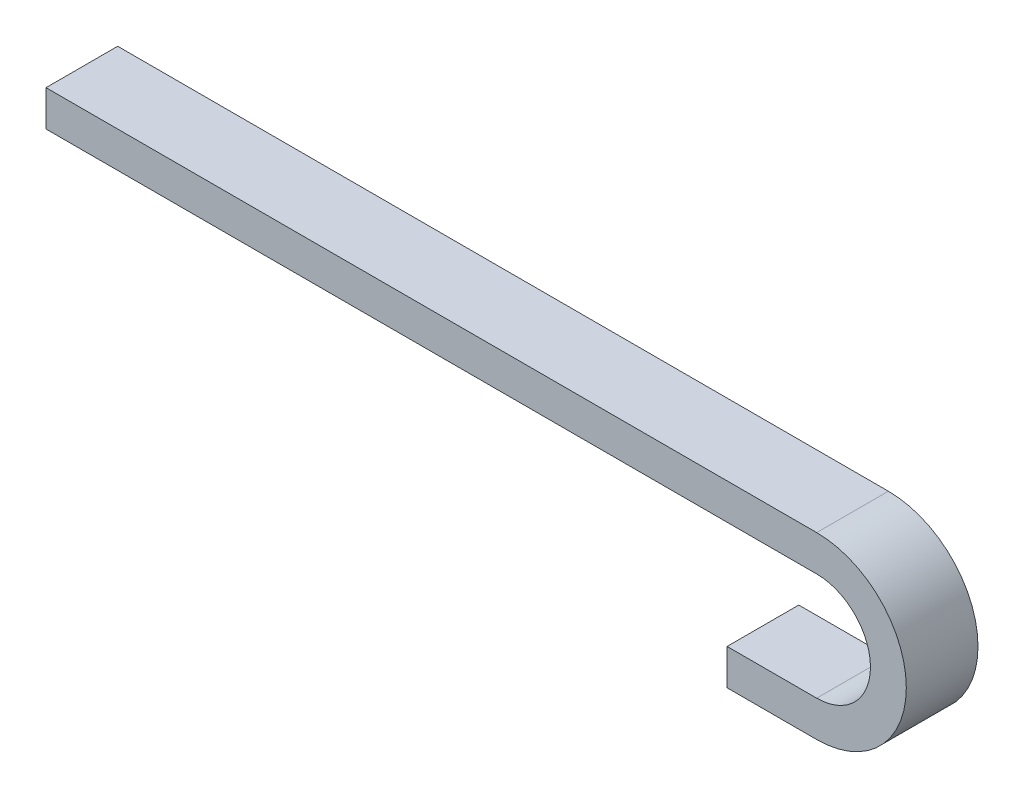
ISO-10303-21;
HEADER;
FILE_DESCRIPTION(('STEP AP214'),'2;1');
FILE_NAME('part.step','',(''),(''),'','','');
FILE_SCHEMA(('AUTOMOTIVE_DESIGN { 1 0 10303 214 1 1 1 1 }'));
ENDSEC;
DATA;
#1=APPLICATION_CONTEXT('core data for automotive mechanical design processes');
#2=APPLICATION_PROTOCOL_DEFINITION('international standard','automotive_design',2000,#1);
#3=PRODUCT_CONTEXT('',#1,'mechanical');
#4=PRODUCT('Part','Part','',(#3));
#5=PRODUCT_RELATED_PRODUCT_CATEGORY('part','',(#4));
#6=PRODUCT_DEFINITION_FORMATION('','',#4);
#7=PRODUCT_DEFINITION_CONTEXT('part definition',#1,'design');
#8=PRODUCT_DEFINITION('design','',#6,#7);
#9=PRODUCT_DEFINITION_SHAPE('','',#8);
#10=(LENGTH_UNIT() NAMED_UNIT(*) SI_UNIT(.MILLI.,.METRE.));
#11=(NAMED_UNIT(*) PLANE_ANGLE_UNIT() SI_UNIT($,.RADIAN.));
#12=(NAMED_UNIT(*) SI_UNIT($,.STERADIAN.) SOLID_ANGLE_UNIT());
#13=UNCERTAINTY_MEASURE_WITH_UNIT(LENGTH_MEASURE(1.E-05),#10,'distance_accuracy_value','');
#14=(GEOMETRIC_REPRESENTATION_CONTEXT(3) GLOBAL_UNCERTAINTY_ASSIGNED_CONTEXT((#13)) GLOBAL_UNIT_ASSIGNED_CONTEXT((#10,
#11,#12)) REPRESENTATION_CONTEXT('',''));
#15=CARTESIAN_POINT('',(0.,0.,0.));
#16=DIRECTION('',(0.,0.,1.));
#17=DIRECTION('',(1.,0.,0.));
#18=AXIS2_PLACEMENT_3D('',#15,#16,#17);
#19=CARTESIAN_POINT('',(125.,225.,50.));
#20=DIRECTION('',(0.,-1.,0.));
#21=DIRECTION('',(1.,0.,0.));
#22=AXIS2_PLACEMENT_3D('',#19,#20,#21);
#23=PLANE('',#22);
#24=DIRECTION('',(-1.,0.,0.));
#25=VECTOR('',#24,1.);
#26=CARTESIAN_POINT('',(125.,225.,-50.));
#27=LINE('',#26,#25);
#28=CARTESIAN_POINT('',(125.,225.,-50.));
#29=VERTEX_POINT('',#28);
#30=CARTESIAN_POINT('',(-950.,225.,-50.));
#31=VERTEX_POINT('',#30);
#32=EDGE_CURVE('E103',#29,#31,#27,.T.);
#33=ORIENTED_EDGE('',*,*,#32,.T.);
#34=DIRECTION('',(0.,0.,-1.));
#35=VECTOR('',#34,1.);
#36=CARTESIAN_POINT('',(-950.,225.,50.));
#37=LINE('',#36,#35);
#38=CARTESIAN_POINT('',(-950.,225.,50.));
#39=VERTEX_POINT('',#38);
#40=EDGE_CURVE('E11',#39,#31,#37,.T.);
#41=ORIENTED_EDGE('',*,*,#40,.F.);
#42=DIRECTION('',(-1.,0.,0.));
#43=VECTOR('',#42,1.);
#44=CARTESIAN_POINT('',(125.,225.,50.));
#45=LINE('',#44,#43);
#46=CARTESIAN_POINT('',(125.,225.,50.));
#47=VERTEX_POINT('',#46);
#48=EDGE_CURVE('E127',#47,#39,#45,.T.);
#49=ORIENTED_EDGE('',*,*,#48,.F.);
#50=DIRECTION('',(0.,0.,-1.));
#51=VECTOR('',#50,1.);
#52=CARTESIAN_POINT('',(125.,225.,50.));
#53=LINE('',#52,#51);
#54=EDGE_CURVE('E104',#47,#29,#53,.T.);
#55=ORIENTED_EDGE('',*,*,#54,.T.);
#56=EDGE_LOOP('',(#33,#41,#49,#55));
#57=FACE_BOUND('',#56,.T.);
#58=ADVANCED_FACE('F28',(#57),#23,.F.);
#59=CARTESIAN_POINT('',(-950.,175.,50.));
#60=DIRECTION('',(-1.,0.,0.));
#61=DIRECTION('',(0.,0.,1.));
#62=AXIS2_PLACEMENT_3D('',#59,#60,#61);
#63=PLANE('',#62);
#64=DIRECTION('',(0.,1.,0.));
#65=VECTOR('',#64,1.);
#66=CARTESIAN_POINT('',(-950.,175.,-50.));
#67=LINE('',#66,#65);
#68=CARTESIAN_POINT('',(-950.,175.,-50.));
#69=VERTEX_POINT('',#68);
#70=EDGE_CURVE('E95',#69,#31,#67,.T.);
#71=ORIENTED_EDGE('',*,*,#70,.F.);
#72=DIRECTION('',(0.,0.,-1.));
#73=VECTOR('',#72,1.);
#74=CARTESIAN_POINT('',(-950.,175.,50.));
#75=LINE('',#74,#73);
#76=CARTESIAN_POINT('',(-950.,175.,50.));
#77=VERTEX_POINT('',#76);
#78=EDGE_CURVE('E35',#77,#69,#75,.T.);
#79=ORIENTED_EDGE('',*,*,#78,.F.);
#80=DIRECTION('',(0.,1.,0.));
#81=VECTOR('',#80,1.);
#82=CARTESIAN_POINT('',(-950.,175.,50.));
#83=LINE('',#82,#81);
#84=EDGE_CURVE('E98',#77,#39,#83,.T.);
#85=ORIENTED_EDGE('',*,*,#84,.T.);
#86=ORIENTED_EDGE('',*,*,#40,.T.);
#87=EDGE_LOOP('',(#71,#79,#85,#86));
#88=FACE_BOUND('',#87,.T.);
#89=ADVANCED_FACE('F93',(#88),#63,.T.);
#90=CARTESIAN_POINT('',(125.,175.,50.));
#91=DIRECTION('',(0.,-1.,0.));
#92=DIRECTION('',(1.,0.,0.));
#93=AXIS2_PLACEMENT_3D('',#90,#91,#92);
#94=PLANE('',#93);
#95=DIRECTION('',(-1.,0.,0.));
#96=VECTOR('',#95,1.);
#97=CARTESIAN_POINT('',(125.,175.,-50.));
#98=LINE('',#97,#96);
#99=CARTESIAN_POINT('',(125.,175.,-50.));
#100=VERTEX_POINT('',#99);
#101=EDGE_CURVE('E111',#100,#69,#98,.T.);
#102=ORIENTED_EDGE('',*,*,#101,.F.);
#103=DIRECTION('',(0.,0.,-1.));
#104=VECTOR('',#103,1.);
#105=CARTESIAN_POINT('',(125.,175.,50.));
#106=LINE('',#105,#104);
#107=CARTESIAN_POINT('',(125.,175.,50.));
#108=VERTEX_POINT('',#107);
#109=EDGE_CURVE('E154',#108,#100,#106,.T.);
#110=ORIENTED_EDGE('',*,*,#109,.F.);
#111=DIRECTION('',(-1.,0.,0.));
#112=VECTOR('',#111,1.);
#113=CARTESIAN_POINT('',(125.,175.,50.));
#114=LINE('',#113,#112);
#115=EDGE_CURVE('E130',#108,#77,#114,.T.);
#116=ORIENTED_EDGE('',*,*,#115,.T.);
#117=ORIENTED_EDGE('',*,*,#78,.T.);
#118=EDGE_LOOP('',(#102,#110,#116,#117));
#119=FACE_BOUND('',#118,.T.);
#120=ADVANCED_FACE('F156',(#119),#94,.T.);
#121=CARTESIAN_POINT('',(125.,100.,50.));
#122=DIRECTION('',(0.,0.,-1.));
#123=DIRECTION('',(-1.,0.,0.));
#124=AXIS2_PLACEMENT_3D('',#121,#122,#123);
#125=CYLINDRICAL_SURFACE('',#124,75.);
#126=CARTESIAN_POINT('',(125.,100.,-50.));
#127=DIRECTION('',(0.,0.,1.));
#128=DIRECTION('',(1.,0.,0.));
#129=AXIS2_PLACEMENT_3D('',#126,#127,#128);
#130=CIRCLE('',#129,75.);
#131=CARTESIAN_POINT('',(125.,25.,-50.));
#132=VERTEX_POINT('',#131);
#133=EDGE_CURVE('E113',#132,#100,#130,.T.);
#134=ORIENTED_EDGE('',*,*,#133,.F.);
#135=DIRECTION('',(0.,0.,-1.));
#136=VECTOR('',#135,1.);
#137=CARTESIAN_POINT('',(125.,25.,50.));
#138=LINE('',#137,#136);
#139=CARTESIAN_POINT('',(125.,25.,50.));
#140=VERTEX_POINT('',#139);
#141=EDGE_CURVE('E152',#140,#132,#138,.T.);
#142=ORIENTED_EDGE('',*,*,#141,.F.);
#143=CARTESIAN_POINT('',(125.,100.,50.));
#144=DIRECTION('',(0.,0.,1.));
#145=DIRECTION('',(1.,0.,0.));
#146=AXIS2_PLACEMENT_3D('',#143,#144,#145);
#147=CIRCLE('',#146,75.);
#148=EDGE_CURVE('E133',#140,#108,#147,.T.);
#149=ORIENTED_EDGE('',*,*,#148,.T.);
#150=ORIENTED_EDGE('',*,*,#109,.T.);
#151=EDGE_LOOP('',(#134,#142,#149,#150));
#152=FACE_BOUND('',#151,.T.);
#153=ADVANCED_FACE('F163',(#152),#125,.F.);
#154=CARTESIAN_POINT('',(0.,25.,50.));
#155=DIRECTION('',(0.,1.,0.));
#156=DIRECTION('',(-1.,0.,0.));
#157=AXIS2_PLACEMENT_3D('',#154,#155,#156);
#158=PLANE('',#157);
#159=DIRECTION('',(1.,0.,0.));
#160=VECTOR('',#159,1.);
#161=CARTESIAN_POINT('',(0.,25.,-50.));
#162=LINE('',#161,#160);
#163=CARTESIAN_POINT('',(0.,25.,-50.));
#164=VERTEX_POINT('',#163);
#165=EDGE_CURVE('E117',#164,#132,#162,.T.);
#166=ORIENTED_EDGE('',*,*,#165,.F.);
#167=DIRECTION('',(0.,0.,-1.));
#168=VECTOR('',#167,1.);
#169=CARTESIAN_POINT('',(0.,25.,50.));
#170=LINE('',#169,#168);
#171=CARTESIAN_POINT('',(0.,25.,50.));
#172=VERTEX_POINT('',#171);
#173=EDGE_CURVE('E150',#172,#164,#170,.T.);
#174=ORIENTED_EDGE('',*,*,#173,.F.);
#175=DIRECTION('',(1.,0.,0.));
#176=VECTOR('',#175,1.);
#177=CARTESIAN_POINT('',(0.,25.,50.));
#178=LINE('',#177,#176);
#179=EDGE_CURVE('E136',#172,#140,#178,.T.);
#180=ORIENTED_EDGE('',*,*,#179,.T.);
#181=ORIENTED_EDGE('',*,*,#141,.T.);
#182=EDGE_LOOP('',(#166,#174,#180,#181));
#183=FACE_BOUND('',#182,.T.);
#184=ADVANCED_FACE('F166',(#183),#158,.T.);
#185=CARTESIAN_POINT('',(0.,-25.,50.));
#186=DIRECTION('',(-1.,0.,0.));
#187=DIRECTION('',(0.,-1.,0.));
#188=AXIS2_PLACEMENT_3D('',#185,#186,#187);
#189=PLANE('',#188);
#190=DIRECTION('',(0.,1.,0.));
#191=VECTOR('',#190,1.);
#192=CARTESIAN_POINT('',(0.,-25.,-50.));
#193=LINE('',#192,#191);
#194=CARTESIAN_POINT('',(0.,-25.,-50.));
#195=VERTEX_POINT('',#194);
#196=EDGE_CURVE('E120',#195,#164,#193,.T.);
#197=ORIENTED_EDGE('',*,*,#196,.F.);
#198=DIRECTION('',(0.,0.,-1.));
#199=VECTOR('',#198,1.);
#200=CARTESIAN_POINT('',(0.,-25.,50.));
#201=LINE('',#200,#199);
#202=CARTESIAN_POINT('',(0.,-25.,50.));
#203=VERTEX_POINT('',#202);
#204=EDGE_CURVE('E148',#203,#195,#201,.T.);
#205=ORIENTED_EDGE('',*,*,#204,.F.);
#206=DIRECTION('',(0.,1.,0.));
#207=VECTOR('',#206,1.);
#208=CARTESIAN_POINT('',(0.,-25.,50.));
#209=LINE('',#208,#207);
#210=EDGE_CURVE('E139',#203,#172,#209,.T.);
#211=ORIENTED_EDGE('',*,*,#210,.T.);
#212=ORIENTED_EDGE('',*,*,#173,.T.);
#213=EDGE_LOOP('',(#197,#205,#211,#212));
#214=FACE_BOUND('',#213,.T.);
#215=ADVANCED_FACE('F169',(#214),#189,.T.);
#216=CARTESIAN_POINT('',(0.,-25.,50.));
#217=DIRECTION('',(0.,1.,0.));
#218=DIRECTION('',(-1.,0.,0.));
#219=AXIS2_PLACEMENT_3D('',#216,#217,#218);
#220=PLANE('',#219);
#221=DIRECTION('',(1.,0.,0.));
#222=VECTOR('',#221,1.);
#223=CARTESIAN_POINT('',(0.,-25.,-50.));
#224=LINE('',#223,#222);
#225=CARTESIAN_POINT('',(125.,-25.,-50.));
#226=VERTEX_POINT('',#225);
#227=EDGE_CURVE('E123',#195,#226,#224,.T.);
#228=ORIENTED_EDGE('',*,*,#227,.T.);
#229=DIRECTION('',(0.,0.,-1.));
#230=VECTOR('',#229,1.);
#231=CARTESIAN_POINT('',(125.,-25.,50.));
#232=LINE('',#231,#230);
#233=CARTESIAN_POINT('',(125.,-25.,50.));
#234=VERTEX_POINT('',#233);
#235=EDGE_CURVE('E145',#234,#226,#232,.T.);
#236=ORIENTED_EDGE('',*,*,#235,.F.);
#237=DIRECTION('',(1.,0.,0.));
#238=VECTOR('',#237,1.);
#239=CARTESIAN_POINT('',(0.,-25.,50.));
#240=LINE('',#239,#238);
#241=EDGE_CURVE('E47',#203,#234,#240,.T.);
#242=ORIENTED_EDGE('',*,*,#241,.F.);
#243=ORIENTED_EDGE('',*,*,#204,.T.);
#244=EDGE_LOOP('',(#228,#236,#242,#243));
#245=FACE_BOUND('',#244,.T.);
#246=ADVANCED_FACE('F172',(#245),#220,.F.);
#247=CARTESIAN_POINT('',(125.,100.,50.));
#248=DIRECTION('',(0.,0.,-1.));
#249=DIRECTION('',(-1.,0.,0.));
#250=AXIS2_PLACEMENT_3D('',#247,#248,#249);
#251=CYLINDRICAL_SURFACE('',#250,125.);
#252=CARTESIAN_POINT('',(125.,100.,-50.));
#253=DIRECTION('',(0.,0.,1.));
#254=DIRECTION('',(1.,0.,0.));
#255=AXIS2_PLACEMENT_3D('',#252,#253,#254);
#256=CIRCLE('',#255,125.);
#257=EDGE_CURVE('E125',#226,#29,#256,.T.);
#258=ORIENTED_EDGE('',*,*,#257,.T.);
#259=ORIENTED_EDGE('',*,*,#54,.F.);
#260=CARTESIAN_POINT('',(125.,100.,50.));
#261=DIRECTION('',(0.,0.,1.));
#262=DIRECTION('',(1.,0.,0.));
#263=AXIS2_PLACEMENT_3D('',#260,#261,#262);
#264=CIRCLE('',#263,125.);
#265=EDGE_CURVE('E42',#234,#47,#264,.T.);
#266=ORIENTED_EDGE('',*,*,#265,.F.);
#267=ORIENTED_EDGE('',*,*,#235,.T.);
#268=EDGE_LOOP('',(#258,#259,#266,#267));
#269=FACE_BOUND('',#268,.T.);
#270=ADVANCED_FACE('F174',(#269),#251,.T.);
#271=CARTESIAN_POINT('',(125.,100.,50.));
#272=DIRECTION('',(0.,0.,1.));
#273=DIRECTION('',(1.,0.,0.));
#274=AXIS2_PLACEMENT_3D('',#271,#272,#273);
#275=PLANE('',#274);
#276=ORIENTED_EDGE('',*,*,#48,.T.);
#277=ORIENTED_EDGE('',*,*,#84,.F.);
#278=ORIENTED_EDGE('',*,*,#115,.F.);
#279=ORIENTED_EDGE('',*,*,#148,.F.);
#280=ORIENTED_EDGE('',*,*,#179,.F.);
#281=ORIENTED_EDGE('',*,*,#210,.F.);
#282=ORIENTED_EDGE('',*,*,#241,.T.);
#283=ORIENTED_EDGE('',*,*,#265,.T.);
#284=EDGE_LOOP('',(#276,#277,#278,#279,#280,#281,#282,#283));
#285=FACE_BOUND('',#284,.T.);
#286=ADVANCED_FACE('F158',(#285),#275,.T.);
#287=CARTESIAN_POINT('',(125.,100.,-50.));
#288=DIRECTION('',(0.,0.,1.));
#289=DIRECTION('',(1.,0.,0.));
#290=AXIS2_PLACEMENT_3D('',#287,#288,#289);
#291=PLANE('',#290);
#292=ORIENTED_EDGE('',*,*,#32,.F.);
#293=ORIENTED_EDGE('',*,*,#257,.F.);
#294=ORIENTED_EDGE('',*,*,#227,.F.);
#295=ORIENTED_EDGE('',*,*,#196,.T.);
#296=ORIENTED_EDGE('',*,*,#165,.T.);
#297=ORIENTED_EDGE('',*,*,#133,.T.);
#298=ORIENTED_EDGE('',*,*,#101,.T.);
#299=ORIENTED_EDGE('',*,*,#70,.T.);
#300=EDGE_LOOP('',(#292,#293,#294,#295,#296,#297,#298,#299));
#301=FACE_BOUND('',#300,.T.);
#302=ADVANCED_FACE('F108',(#301),#291,.F.);
#303=CLOSED_SHELL('',(#58,#89,#120,#153,#184,#215,#246,#270,#286,#302));
#304=MANIFOLD_SOLID_BREP('B2',#303);
#305=ADVANCED_BREP_SHAPE_REPRESENTATION('',(#18,#304),#14);
#306=SHAPE_DEFINITION_REPRESENTATION(#9,#305);
ENDSEC;
END-ISO-10303-21;
